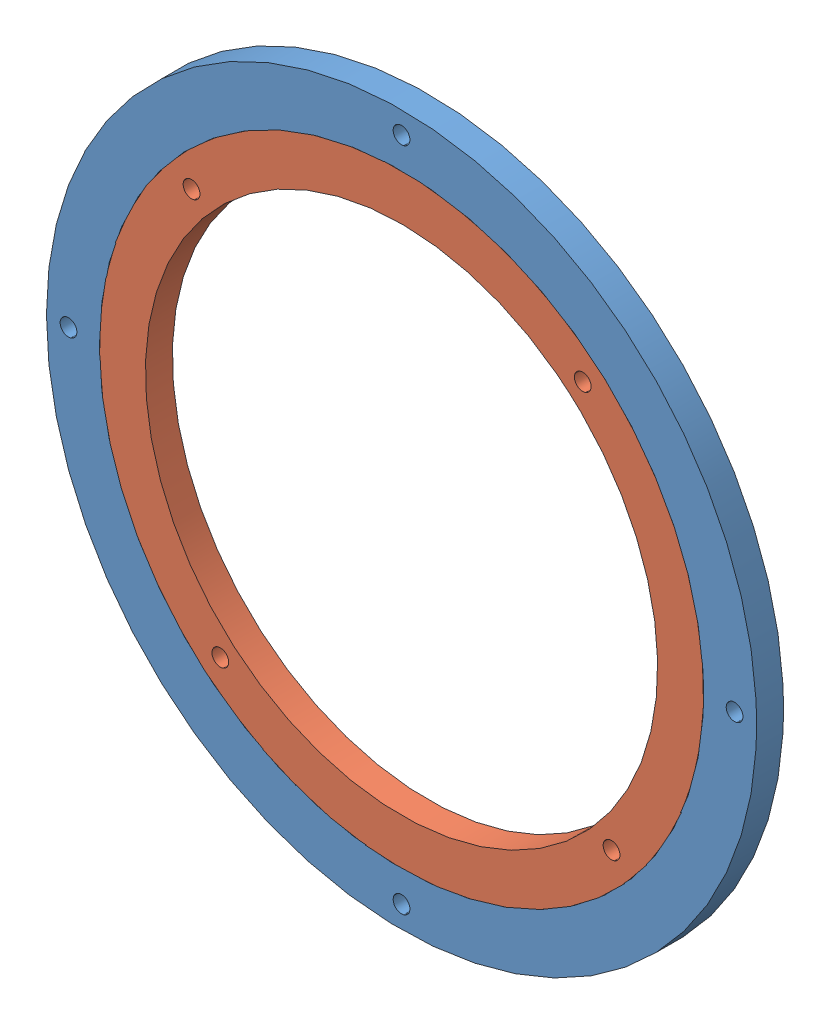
SolidWorks assembly LS_Bearing.SLDASM, configuration Default (file format 11000). Lengths in mm.
Overall size (241.18 241.18 7.62).
2 component instances, 2 part files, 2 mates.
Components (placement in the parent):
- Outer_Ring-1: Outer_Ring.SLDPRT [Default] at (50.3156 96.6215 168.6859) size (201 201 7.62)
- Inner_Ring-1: Inner_Ring.SLDPRT [Default] at (50.3156 96.6215 168.6859) x (0.65335 0.757056 0) z (0 0 1) size (171 171 7.62)
Mates (geometry in assembly coordinates):
- Concentric1: concentric: circle of Outer_Ring-1; circle of Inner_Ring-1
- Coincident1: coincident: plane of Outer_Ring-1 through (50.3156 96.6215 176.3059) normal (0 0 1); plane of Inner_Ring-1 through (50.3156 96.6215 176.3059) normal (0 0 1)
